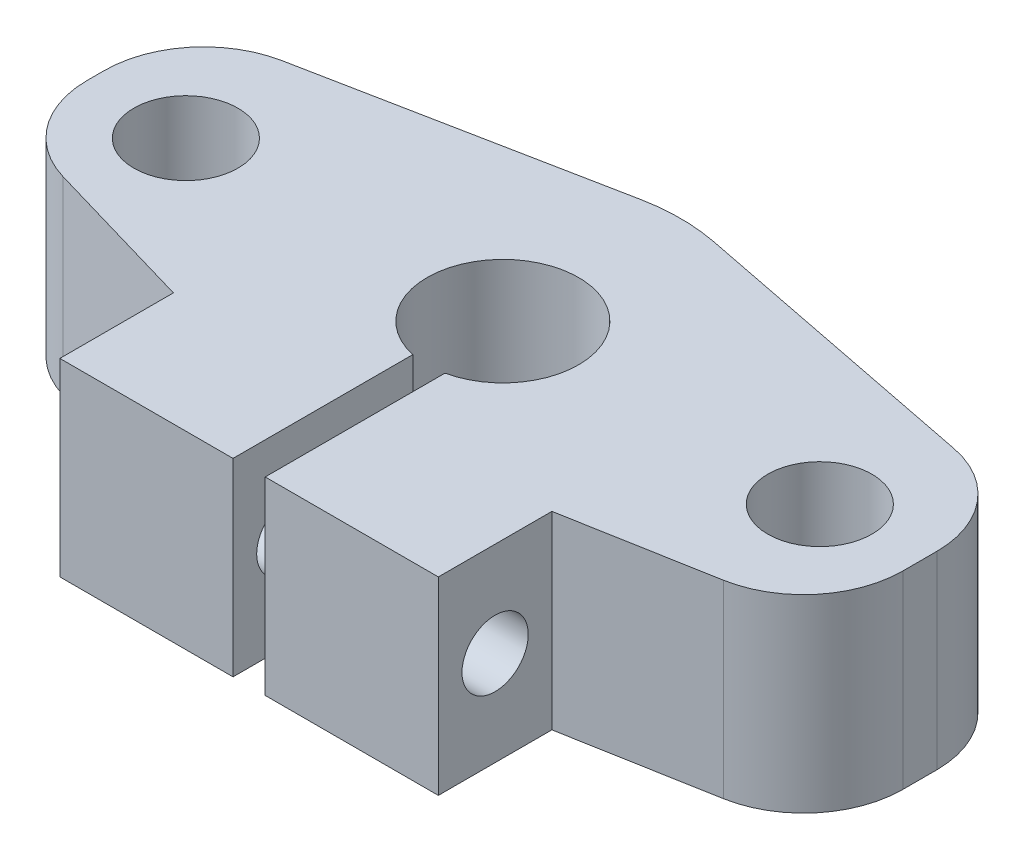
ISO-10303-21;
HEADER;
FILE_DESCRIPTION(('STEP AP214'),'2;1');
FILE_NAME('part.step','',(''),(''),'','','');
FILE_SCHEMA(('AUTOMOTIVE_DESIGN { 1 0 10303 214 1 1 1 1 }'));
ENDSEC;
DATA;
#1=APPLICATION_CONTEXT('core data for automotive mechanical design processes');
#2=APPLICATION_PROTOCOL_DEFINITION('international standard','automotive_design',2000,#1);
#3=PRODUCT_CONTEXT('',#1,'mechanical');
#4=PRODUCT('Part','Part','',(#3));
#5=PRODUCT_RELATED_PRODUCT_CATEGORY('part','',(#4));
#6=PRODUCT_DEFINITION_FORMATION('','',#4);
#7=PRODUCT_DEFINITION_CONTEXT('part definition',#1,'design');
#8=PRODUCT_DEFINITION('design','',#6,#7);
#9=PRODUCT_DEFINITION_SHAPE('','',#8);
#10=(LENGTH_UNIT() NAMED_UNIT(*) SI_UNIT(.MILLI.,.METRE.));
#11=(NAMED_UNIT(*) PLANE_ANGLE_UNIT() SI_UNIT($,.RADIAN.));
#12=(NAMED_UNIT(*) SI_UNIT($,.STERADIAN.) SOLID_ANGLE_UNIT());
#13=UNCERTAINTY_MEASURE_WITH_UNIT(LENGTH_MEASURE(1.E-05),#10,'distance_accuracy_value','');
#14=(GEOMETRIC_REPRESENTATION_CONTEXT(3) GLOBAL_UNCERTAINTY_ASSIGNED_CONTEXT((#13)) GLOBAL_UNIT_ASSIGNED_CONTEXT((#10,
#11,#12)) REPRESENTATION_CONTEXT('',''));
#15=CARTESIAN_POINT('',(0.,0.,0.));
#16=DIRECTION('',(0.,0.,1.));
#17=DIRECTION('',(1.,0.,0.));
#18=AXIS2_PLACEMENT_3D('',#15,#16,#17);
#19=CARTESIAN_POINT('',(0.,10.,-13.409530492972));
#20=DIRECTION('',(0.,1.,0.));
#21=DIRECTION('',(0.,0.,1.));
#22=AXIS2_PLACEMENT_3D('',#19,#20,#21);
#23=PLANE('',#22);
#24=CARTESIAN_POINT('',(16.75,10.,-13.409530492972));
#25=DIRECTION('',(0.,1.,0.));
#26=DIRECTION('',(0.,0.,1.));
#27=AXIS2_PLACEMENT_3D('',#24,#25,#26);
#28=CIRCLE('',#27,2.75);
#29=CARTESIAN_POINT('',(16.75,10.,-10.659530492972));
#30=VERTEX_POINT('',#29);
#31=EDGE_CURVE('E319',#30,#30,#28,.T.);
#32=ORIENTED_EDGE('',*,*,#31,.F.);
#33=EDGE_LOOP('',(#32));
#34=FACE_BOUND('',#33,.T.);
#35=DIRECTION('',(-0.981087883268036,0.,-0.193562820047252));
#36=VECTOR('',#35,1.);
#37=CARTESIAN_POINT('',(22.,10.,-18.659530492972));
#38=LINE('',#37,#36);
#39=CARTESIAN_POINT('',(17.7662048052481,10.,-19.4948331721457));
#40=VERTEX_POINT('',#39);
#41=CARTESIAN_POINT('',(1.93562820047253,10.,-22.618112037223));
#42=VERTEX_POINT('',#41);
#43=EDGE_CURVE('E302',#40,#42,#38,.T.);
#44=ORIENTED_EDGE('',*,*,#43,.T.);
#45=CARTESIAN_POINT('',(0.,10.,-12.8072332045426));
#46=DIRECTION('',(0.,1.,0.));
#47=DIRECTION('',(0.,0.,1.));
#48=AXIS2_PLACEMENT_3D('',#45,#46,#47);
#49=CIRCLE('',#48,10.);
#50=CARTESIAN_POINT('',(-1.93562820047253,10.,-22.618112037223));
#51=VERTEX_POINT('',#50);
#52=EDGE_CURVE('E11',#42,#51,#49,.T.);
#53=ORIENTED_EDGE('',*,*,#52,.T.);
#54=DIRECTION('',(-0.981087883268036,0.,0.193562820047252));
#55=VECTOR('',#54,1.);
#56=CARTESIAN_POINT('',(0.,10.,-23.));
#57=LINE('',#56,#55);
#58=CARTESIAN_POINT('',(-17.7662048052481,10.,-19.4948331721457));
#59=VERTEX_POINT('',#58);
#60=EDGE_CURVE('E233',#51,#59,#57,.T.);
#61=ORIENTED_EDGE('',*,*,#60,.T.);
#62=CARTESIAN_POINT('',(-16.75,10.,-14.3441217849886));
#63=DIRECTION('',(0.,1.,0.));
#64=DIRECTION('',(0.,0.,1.));
#65=AXIS2_PLACEMENT_3D('',#62,#63,#64);
#66=CIRCLE('',#65,5.25);
#67=CARTESIAN_POINT('',(-22.,10.,-14.3441217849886));
#68=VERTEX_POINT('',#67);
#69=EDGE_CURVE('E196',#59,#68,#66,.T.);
#70=ORIENTED_EDGE('',*,*,#69,.T.);
#71=DIRECTION('',(0.,0.,1.));
#72=VECTOR('',#71,1.);
#73=CARTESIAN_POINT('',(-22.,10.,-9.5));
#74=LINE('',#73,#72);
#75=CARTESIAN_POINT('',(-22.,10.,-13.4375));
#76=VERTEX_POINT('',#75);
#77=EDGE_CURVE('E306',#68,#76,#74,.T.);
#78=ORIENTED_EDGE('',*,*,#77,.T.);
#79=CARTESIAN_POINT('',(-16.75,10.,-13.4375));
#80=DIRECTION('',(0.,1.,0.));
#81=DIRECTION('',(0.,0.,1.));
#82=AXIS2_PLACEMENT_3D('',#79,#80,#81);
#83=CIRCLE('',#82,5.25);
#84=CARTESIAN_POINT('',(-18.22,10.,-8.3975));
#85=VERTEX_POINT('',#84);
#86=EDGE_CURVE('E205',#76,#85,#83,.T.);
#87=ORIENTED_EDGE('',*,*,#86,.T.);
#88=DIRECTION('',(0.96,0.,0.28));
#89=VECTOR('',#88,1.);
#90=CARTESIAN_POINT('',(-10.,10.,-6.));
#91=LINE('',#90,#89);
#92=CARTESIAN_POINT('',(-10.,10.,-6.));
#93=VERTEX_POINT('',#92);
#94=EDGE_CURVE('E314',#85,#93,#91,.T.);
#95=ORIENTED_EDGE('',*,*,#94,.T.);
#96=DIRECTION('',(0.,0.,1.));
#97=VECTOR('',#96,1.);
#98=CARTESIAN_POINT('',(-10.,10.,0.));
#99=LINE('',#98,#97);
#100=CARTESIAN_POINT('',(-10.,10.,0.));
#101=VERTEX_POINT('',#100);
#102=EDGE_CURVE('E316',#93,#101,#99,.T.);
#103=ORIENTED_EDGE('',*,*,#102,.T.);
#104=DIRECTION('',(1.,0.,0.));
#105=VECTOR('',#104,1.);
#106=CARTESIAN_POINT('',(-10.,10.,0.));
#107=LINE('',#106,#105);
#108=CARTESIAN_POINT('',(-0.85,10.,0.));
#109=VERTEX_POINT('',#108);
#110=EDGE_CURVE('E173',#101,#109,#107,.T.);
#111=ORIENTED_EDGE('',*,*,#110,.T.);
#112=DIRECTION('',(0.,0.,-1.));
#113=VECTOR('',#112,1.);
#114=CARTESIAN_POINT('',(-0.85,10.,0.));
#115=LINE('',#114,#113);
#116=CARTESIAN_POINT('',(-0.85,10.,-9.5));
#117=VERTEX_POINT('',#116);
#118=EDGE_CURVE('E168',#109,#117,#115,.T.);
#119=ORIENTED_EDGE('',*,*,#118,.T.);
#120=CARTESIAN_POINT('',(0.,10.,-13.409530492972));
#121=DIRECTION('',(0.,-1.,0.));
#122=DIRECTION('',(0.,0.,1.));
#123=AXIS2_PLACEMENT_3D('',#120,#121,#122);
#124=CIRCLE('',#123,4.00086599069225);
#125=CARTESIAN_POINT('',(0.85,10.,-9.5));
#126=VERTEX_POINT('',#125);
#127=EDGE_CURVE('E157',#117,#126,#124,.T.);
#128=ORIENTED_EDGE('',*,*,#127,.T.);
#129=DIRECTION('',(0.,0.,1.));
#130=VECTOR('',#129,1.);
#131=CARTESIAN_POINT('',(0.85,10.,0.));
#132=LINE('',#131,#130);
#133=CARTESIAN_POINT('',(0.85,10.,0.));
#134=VERTEX_POINT('',#133);
#135=EDGE_CURVE('E167',#126,#134,#132,.T.);
#136=ORIENTED_EDGE('',*,*,#135,.T.);
#137=DIRECTION('',(1.,0.,0.));
#138=VECTOR('',#137,1.);
#139=CARTESIAN_POINT('',(10.,10.,0.));
#140=LINE('',#139,#138);
#141=CARTESIAN_POINT('',(10.,10.,0.));
#142=VERTEX_POINT('',#141);
#143=EDGE_CURVE('E275',#134,#142,#140,.T.);
#144=ORIENTED_EDGE('',*,*,#143,.T.);
#145=DIRECTION('',(0.,0.,-1.));
#146=VECTOR('',#145,1.);
#147=CARTESIAN_POINT('',(10.,10.,0.));
#148=LINE('',#147,#146);
#149=CARTESIAN_POINT('',(10.,10.,-6.));
#150=VERTEX_POINT('',#149);
#151=EDGE_CURVE('E322',#142,#150,#148,.T.);
#152=ORIENTED_EDGE('',*,*,#151,.T.);
#153=DIRECTION('',(0.984190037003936,0.,-0.177115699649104));
#154=VECTOR('',#153,1.);
#155=CARTESIAN_POINT('',(10.,10.,-6.));
#156=LINE('',#155,#154);
#157=CARTESIAN_POINT('',(17.6798574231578,10.,-7.38207385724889));
#158=VERTEX_POINT('',#157);
#159=EDGE_CURVE('E308',#150,#158,#156,.T.);
#160=ORIENTED_EDGE('',*,*,#159,.T.);
#161=CARTESIAN_POINT('',(16.75,10.,-12.5490715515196));
#162=DIRECTION('',(0.,1.,0.));
#163=DIRECTION('',(0.,0.,1.));
#164=AXIS2_PLACEMENT_3D('',#161,#162,#163);
#165=CIRCLE('',#164,5.25);
#166=CARTESIAN_POINT('',(22.,10.,-12.5490715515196));
#167=VERTEX_POINT('',#166);
#168=EDGE_CURVE('E214',#158,#167,#165,.T.);
#169=ORIENTED_EDGE('',*,*,#168,.T.);
#170=DIRECTION('',(0.,0.,-1.));
#171=VECTOR('',#170,1.);
#172=CARTESIAN_POINT('',(22.,10.,-10.659530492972));
#173=LINE('',#172,#171);
#174=CARTESIAN_POINT('',(22.,10.,-14.3441217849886));
#175=VERTEX_POINT('',#174);
#176=EDGE_CURVE('E303',#167,#175,#173,.T.);
#177=ORIENTED_EDGE('',*,*,#176,.T.);
#178=CARTESIAN_POINT('',(16.75,10.,-14.3441217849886));
#179=DIRECTION('',(0.,1.,0.));
#180=DIRECTION('',(0.,0.,1.));
#181=AXIS2_PLACEMENT_3D('',#178,#179,#180);
#182=CIRCLE('',#181,5.25);
#183=EDGE_CURVE('E223',#175,#40,#182,.T.);
#184=ORIENTED_EDGE('',*,*,#183,.T.);
#185=EDGE_LOOP('',(#44,#53,#61,#70,#78,#87,#95,#103,#111,#119,#128,#136,#144,#152,#160,#169,
#177,#184));
#186=FACE_BOUND('',#185,.T.);
#187=CARTESIAN_POINT('',(-16.75,10.,-13.409530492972));
#188=DIRECTION('',(0.,1.,0.));
#189=DIRECTION('',(0.,0.,1.));
#190=AXIS2_PLACEMENT_3D('',#187,#188,#189);
#191=CIRCLE('',#190,2.75);
#192=CARTESIAN_POINT('',(-16.75,10.,-10.659530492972));
#193=VERTEX_POINT('',#192);
#194=EDGE_CURVE('E567',#193,#193,#191,.T.);
#195=ORIENTED_EDGE('',*,*,#194,.F.);
#196=EDGE_LOOP('',(#195));
#197=FACE_BOUND('',#196,.T.);
#198=ADVANCED_FACE('F32',(#34,#186,#197),#23,.T.);
#199=CARTESIAN_POINT('',(0.,0.,-13.409530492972));
#200=DIRECTION('',(0.,1.,0.));
#201=DIRECTION('',(0.,0.,1.));
#202=AXIS2_PLACEMENT_3D('',#199,#200,#201);
#203=PLANE('',#202);
#204=CARTESIAN_POINT('',(16.75,0.,-13.409530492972));
#205=DIRECTION('',(0.,1.,0.));
#206=DIRECTION('',(0.,0.,1.));
#207=AXIS2_PLACEMENT_3D('',#204,#205,#206);
#208=CIRCLE('',#207,2.75);
#209=CARTESIAN_POINT('',(16.75,0.,-10.659530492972));
#210=VERTEX_POINT('',#209);
#211=EDGE_CURVE('E575',#210,#210,#208,.T.);
#212=ORIENTED_EDGE('',*,*,#211,.T.);
#213=EDGE_LOOP('',(#212));
#214=FACE_BOUND('',#213,.T.);
#215=DIRECTION('',(-0.981087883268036,0.,0.193562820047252));
#216=VECTOR('',#215,1.);
#217=CARTESIAN_POINT('',(0.,0.,-23.));
#218=LINE('',#217,#216);
#219=CARTESIAN_POINT('',(-1.93562820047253,0.,-22.618112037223));
#220=VERTEX_POINT('',#219);
#221=CARTESIAN_POINT('',(-17.7662048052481,0.,-19.4948331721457));
#222=VERTEX_POINT('',#221);
#223=EDGE_CURVE('E232',#220,#222,#218,.T.);
#224=ORIENTED_EDGE('',*,*,#223,.F.);
#225=CARTESIAN_POINT('',(0.,0.,-12.8072332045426));
#226=DIRECTION('',(0.,1.,0.));
#227=DIRECTION('',(0.,0.,1.));
#228=AXIS2_PLACEMENT_3D('',#225,#226,#227);
#229=CIRCLE('',#228,10.);
#230=CARTESIAN_POINT('',(1.93562820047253,0.,-22.618112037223));
#231=VERTEX_POINT('',#230);
#232=EDGE_CURVE('E54',#220,#231,#229,.F.);
#233=ORIENTED_EDGE('',*,*,#232,.T.);
#234=DIRECTION('',(-0.981087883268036,0.,-0.193562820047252));
#235=VECTOR('',#234,1.);
#236=CARTESIAN_POINT('',(22.,0.,-18.659530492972));
#237=LINE('',#236,#235);
#238=CARTESIAN_POINT('',(17.7662048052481,0.,-19.4948331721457));
#239=VERTEX_POINT('',#238);
#240=EDGE_CURVE('E241',#239,#231,#237,.T.);
#241=ORIENTED_EDGE('',*,*,#240,.F.);
#242=CARTESIAN_POINT('',(16.75,0.,-14.3441217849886));
#243=DIRECTION('',(0.,1.,0.));
#244=DIRECTION('',(0.,0.,1.));
#245=AXIS2_PLACEMENT_3D('',#242,#243,#244);
#246=CIRCLE('',#245,5.25);
#247=CARTESIAN_POINT('',(22.,0.,-14.3441217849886));
#248=VERTEX_POINT('',#247);
#249=EDGE_CURVE('E219',#239,#248,#246,.F.);
#250=ORIENTED_EDGE('',*,*,#249,.T.);
#251=DIRECTION('',(0.,0.,-1.));
#252=VECTOR('',#251,1.);
#253=CARTESIAN_POINT('',(22.,0.,-16.159530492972));
#254=LINE('',#253,#252);
#255=CARTESIAN_POINT('',(22.,0.,-12.5490715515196));
#256=VERTEX_POINT('',#255);
#257=EDGE_CURVE('E246',#256,#248,#254,.T.);
#258=ORIENTED_EDGE('',*,*,#257,.F.);
#259=CARTESIAN_POINT('',(16.75,0.,-12.5490715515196));
#260=DIRECTION('',(0.,1.,0.));
#261=DIRECTION('',(0.,0.,1.));
#262=AXIS2_PLACEMENT_3D('',#259,#260,#261);
#263=CIRCLE('',#262,5.25);
#264=CARTESIAN_POINT('',(17.6798574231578,0.,-7.38207385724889));
#265=VERTEX_POINT('',#264);
#266=EDGE_CURVE('E210',#256,#265,#263,.F.);
#267=ORIENTED_EDGE('',*,*,#266,.T.);
#268=DIRECTION('',(0.984190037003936,0.,-0.177115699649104));
#269=VECTOR('',#268,1.);
#270=CARTESIAN_POINT('',(10.,0.,-6.));
#271=LINE('',#270,#269);
#272=CARTESIAN_POINT('',(10.,0.,-6.));
#273=VERTEX_POINT('',#272);
#274=EDGE_CURVE('E283',#273,#265,#271,.T.);
#275=ORIENTED_EDGE('',*,*,#274,.F.);
#276=DIRECTION('',(0.,0.,-1.));
#277=VECTOR('',#276,1.);
#278=CARTESIAN_POINT('',(10.,0.,0.));
#279=LINE('',#278,#277);
#280=CARTESIAN_POINT('',(10.,0.,0.));
#281=VERTEX_POINT('',#280);
#282=EDGE_CURVE('E281',#281,#273,#279,.T.);
#283=ORIENTED_EDGE('',*,*,#282,.F.);
#284=DIRECTION('',(1.,0.,0.));
#285=VECTOR('',#284,1.);
#286=CARTESIAN_POINT('',(10.,0.,0.));
#287=LINE('',#286,#285);
#288=CARTESIAN_POINT('',(0.85,0.,0.));
#289=VERTEX_POINT('',#288);
#290=EDGE_CURVE('E274',#289,#281,#287,.T.);
#291=ORIENTED_EDGE('',*,*,#290,.F.);
#292=DIRECTION('',(0.,0.,1.));
#293=VECTOR('',#292,1.);
#294=CARTESIAN_POINT('',(0.85,0.,0.));
#295=LINE('',#294,#293);
#296=CARTESIAN_POINT('',(0.85,0.,-9.5));
#297=VERTEX_POINT('',#296);
#298=EDGE_CURVE('E279',#297,#289,#295,.T.);
#299=ORIENTED_EDGE('',*,*,#298,.F.);
#300=CARTESIAN_POINT('',(0.,0.,-13.409530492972));
#301=DIRECTION('',(0.,-1.,0.));
#302=DIRECTION('',(0.,0.,1.));
#303=AXIS2_PLACEMENT_3D('',#300,#301,#302);
#304=CIRCLE('',#303,4.00086599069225);
#305=CARTESIAN_POINT('',(-0.85,0.,-9.5));
#306=VERTEX_POINT('',#305);
#307=EDGE_CURVE('E285',#306,#297,#304,.T.);
#308=ORIENTED_EDGE('',*,*,#307,.F.);
#309=DIRECTION('',(0.,0.,-1.));
#310=VECTOR('',#309,1.);
#311=CARTESIAN_POINT('',(-0.85,0.,0.));
#312=LINE('',#311,#310);
#313=CARTESIAN_POINT('',(-0.85,0.,0.));
#314=VERTEX_POINT('',#313);
#315=EDGE_CURVE('E181',#314,#306,#312,.T.);
#316=ORIENTED_EDGE('',*,*,#315,.F.);
#317=DIRECTION('',(1.,0.,0.));
#318=VECTOR('',#317,1.);
#319=CARTESIAN_POINT('',(-10.,0.,0.));
#320=LINE('',#319,#318);
#321=CARTESIAN_POINT('',(-10.,0.,0.));
#322=VERTEX_POINT('',#321);
#323=EDGE_CURVE('E177',#322,#314,#320,.T.);
#324=ORIENTED_EDGE('',*,*,#323,.F.);
#325=DIRECTION('',(0.,0.,1.));
#326=VECTOR('',#325,1.);
#327=CARTESIAN_POINT('',(-10.,0.,0.));
#328=LINE('',#327,#326);
#329=CARTESIAN_POINT('',(-10.,0.,-6.));
#330=VERTEX_POINT('',#329);
#331=EDGE_CURVE('E251',#330,#322,#328,.T.);
#332=ORIENTED_EDGE('',*,*,#331,.F.);
#333=DIRECTION('',(0.96,0.,0.28));
#334=VECTOR('',#333,1.);
#335=CARTESIAN_POINT('',(-10.,0.,-6.));
#336=LINE('',#335,#334);
#337=CARTESIAN_POINT('',(-18.22,0.,-8.3975));
#338=VERTEX_POINT('',#337);
#339=EDGE_CURVE('E244',#338,#330,#336,.T.);
#340=ORIENTED_EDGE('',*,*,#339,.F.);
#341=CARTESIAN_POINT('',(-16.75,0.,-13.4375));
#342=DIRECTION('',(0.,1.,0.));
#343=DIRECTION('',(0.,0.,1.));
#344=AXIS2_PLACEMENT_3D('',#341,#342,#343);
#345=CIRCLE('',#344,5.25);
#346=CARTESIAN_POINT('',(-22.,0.,-13.4375));
#347=VERTEX_POINT('',#346);
#348=EDGE_CURVE('E201',#338,#347,#345,.F.);
#349=ORIENTED_EDGE('',*,*,#348,.T.);
#350=DIRECTION('',(0.,0.,1.));
#351=VECTOR('',#350,1.);
#352=CARTESIAN_POINT('',(-22.,0.,-9.5));
#353=LINE('',#352,#351);
#354=CARTESIAN_POINT('',(-22.,0.,-14.3441217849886));
#355=VERTEX_POINT('',#354);
#356=EDGE_CURVE('E240',#355,#347,#353,.T.);
#357=ORIENTED_EDGE('',*,*,#356,.F.);
#358=CARTESIAN_POINT('',(-16.75,0.,-14.3441217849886));
#359=DIRECTION('',(0.,1.,0.));
#360=DIRECTION('',(0.,0.,1.));
#361=AXIS2_PLACEMENT_3D('',#358,#359,#360);
#362=CIRCLE('',#361,5.25);
#363=EDGE_CURVE('E185',#355,#222,#362,.F.);
#364=ORIENTED_EDGE('',*,*,#363,.T.);
#365=EDGE_LOOP('',(#224,#233,#241,#250,#258,#267,#275,#283,#291,#299,#308,#316,#324,#332,#340,
#349,#357,#364));
#366=FACE_BOUND('',#365,.T.);
#367=CARTESIAN_POINT('',(-16.75,0.,-13.409530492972));
#368=DIRECTION('',(0.,1.,0.));
#369=DIRECTION('',(0.,0.,1.));
#370=AXIS2_PLACEMENT_3D('',#367,#368,#369);
#371=CIRCLE('',#370,2.75);
#372=CARTESIAN_POINT('',(-16.75,0.,-10.659530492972));
#373=VERTEX_POINT('',#372);
#374=EDGE_CURVE('E563',#373,#373,#371,.T.);
#375=ORIENTED_EDGE('',*,*,#374,.T.);
#376=EDGE_LOOP('',(#375));
#377=FACE_BOUND('',#376,.T.);
#378=ADVANCED_FACE('F236',(#214,#366,#377),#203,.F.);
#379=CARTESIAN_POINT('',(-0.85,10.,0.));
#380=DIRECTION('',(-1.,0.,0.));
#381=DIRECTION('',(0.,0.,1.));
#382=AXIS2_PLACEMENT_3D('',#379,#380,#381);
#383=PLANE('',#382);
#384=CARTESIAN_POINT('',(-0.85,5.,-3.));
#385=DIRECTION('',(-1.,0.,0.));
#386=DIRECTION('',(0.,0.,1.));
#387=AXIS2_PLACEMENT_3D('',#384,#385,#386);
#388=CIRCLE('',#387,1.75);
#389=CARTESIAN_POINT('',(-0.85,5.,-1.25));
#390=VERTEX_POINT('',#389);
#391=EDGE_CURVE('E561',#390,#390,#388,.T.);
#392=ORIENTED_EDGE('',*,*,#391,.T.);
#393=EDGE_LOOP('',(#392));
#394=FACE_BOUND('',#393,.T.);
#395=ORIENTED_EDGE('',*,*,#315,.T.);
#396=DIRECTION('',(0.,-1.,0.));
#397=VECTOR('',#396,1.);
#398=CARTESIAN_POINT('',(-0.85,10.,-9.5));
#399=LINE('',#398,#397);
#400=EDGE_CURVE('E161',#117,#306,#399,.T.);
#401=ORIENTED_EDGE('',*,*,#400,.F.);
#402=ORIENTED_EDGE('',*,*,#118,.F.);
#403=DIRECTION('',(0.,-1.,0.));
#404=VECTOR('',#403,1.);
#405=CARTESIAN_POINT('',(-0.85,10.,0.));
#406=LINE('',#405,#404);
#407=EDGE_CURVE('E254',#109,#314,#406,.T.);
#408=ORIENTED_EDGE('',*,*,#407,.T.);
#409=EDGE_LOOP('',(#395,#401,#402,#408));
#410=FACE_BOUND('',#409,.T.);
#411=ADVANCED_FACE('F179',(#394,#410),#383,.F.);
#412=CARTESIAN_POINT('',(0.,10.,-13.409530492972));
#413=DIRECTION('',(0.,-1.,0.));
#414=DIRECTION('',(0.,0.,-1.));
#415=AXIS2_PLACEMENT_3D('',#412,#413,#414);
#416=CYLINDRICAL_SURFACE('',#415,4.00086599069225);
#417=ORIENTED_EDGE('',*,*,#307,.T.);
#418=DIRECTION('',(0.,-1.,0.));
#419=VECTOR('',#418,1.);
#420=CARTESIAN_POINT('',(0.85,10.,-9.5));
#421=LINE('',#420,#419);
#422=EDGE_CURVE('E164',#126,#297,#421,.T.);
#423=ORIENTED_EDGE('',*,*,#422,.F.);
#424=ORIENTED_EDGE('',*,*,#127,.F.);
#425=ORIENTED_EDGE('',*,*,#400,.T.);
#426=EDGE_LOOP('',(#417,#423,#424,#425));
#427=FACE_BOUND('',#426,.T.);
#428=ADVANCED_FACE('F159',(#427),#416,.F.);
#429=CARTESIAN_POINT('',(0.85,10.,0.));
#430=DIRECTION('',(1.,0.,0.));
#431=DIRECTION('',(0.,0.,-1.));
#432=AXIS2_PLACEMENT_3D('',#429,#430,#431);
#433=PLANE('',#432);
#434=CARTESIAN_POINT('',(0.85,5.,-3.));
#435=DIRECTION('',(1.,0.,0.));
#436=DIRECTION('',(0.,0.,-1.));
#437=AXIS2_PLACEMENT_3D('',#434,#435,#436);
#438=CIRCLE('',#437,1.75);
#439=CARTESIAN_POINT('',(0.85,5.,-4.75));
#440=VERTEX_POINT('',#439);
#441=EDGE_CURVE('E564',#440,#440,#438,.T.);
#442=ORIENTED_EDGE('',*,*,#441,.T.);
#443=EDGE_LOOP('',(#442));
#444=FACE_BOUND('',#443,.T.);
#445=ORIENTED_EDGE('',*,*,#298,.T.);
#446=DIRECTION('',(0.,-1.,0.));
#447=VECTOR('',#446,1.);
#448=CARTESIAN_POINT('',(0.85,10.,0.));
#449=LINE('',#448,#447);
#450=EDGE_CURVE('E187',#134,#289,#449,.T.);
#451=ORIENTED_EDGE('',*,*,#450,.F.);
#452=ORIENTED_EDGE('',*,*,#135,.F.);
#453=ORIENTED_EDGE('',*,*,#422,.T.);
#454=EDGE_LOOP('',(#445,#451,#452,#453));
#455=FACE_BOUND('',#454,.T.);
#456=ADVANCED_FACE('F320',(#444,#455),#433,.F.);
#457=CARTESIAN_POINT('',(10.,10.,0.));
#458=DIRECTION('',(0.,0.,-1.));
#459=DIRECTION('',(-1.,0.,0.));
#460=AXIS2_PLACEMENT_3D('',#457,#458,#459);
#461=PLANE('',#460);
#462=ORIENTED_EDGE('',*,*,#290,.T.);
#463=DIRECTION('',(0.,-1.,0.));
#464=VECTOR('',#463,1.);
#465=CARTESIAN_POINT('',(10.,10.,0.));
#466=LINE('',#465,#464);
#467=EDGE_CURVE('E265',#142,#281,#466,.T.);
#468=ORIENTED_EDGE('',*,*,#467,.F.);
#469=ORIENTED_EDGE('',*,*,#143,.F.);
#470=ORIENTED_EDGE('',*,*,#450,.T.);
#471=EDGE_LOOP('',(#462,#468,#469,#470));
#472=FACE_BOUND('',#471,.T.);
#473=ADVANCED_FACE('F272',(#472),#461,.F.);
#474=CARTESIAN_POINT('',(10.,10.,0.));
#475=DIRECTION('',(-1.,0.,0.));
#476=DIRECTION('',(0.,0.,1.));
#477=AXIS2_PLACEMENT_3D('',#474,#475,#476);
#478=PLANE('',#477);
#479=CARTESIAN_POINT('',(10.,5.,-3.));
#480=DIRECTION('',(-1.,0.,0.));
#481=DIRECTION('',(0.,0.,1.));
#482=AXIS2_PLACEMENT_3D('',#479,#480,#481);
#483=CIRCLE('',#482,1.75);
#484=CARTESIAN_POINT('',(10.,5.,-1.25));
#485=VERTEX_POINT('',#484);
#486=EDGE_CURVE('E570',#485,#485,#483,.T.);
#487=ORIENTED_EDGE('',*,*,#486,.T.);
#488=EDGE_LOOP('',(#487));
#489=FACE_BOUND('',#488,.T.);
#490=ORIENTED_EDGE('',*,*,#282,.T.);
#491=DIRECTION('',(0.,-1.,0.));
#492=VECTOR('',#491,1.);
#493=CARTESIAN_POINT('',(10.,10.,-6.));
#494=LINE('',#493,#492);
#495=EDGE_CURVE('E262',#150,#273,#494,.T.);
#496=ORIENTED_EDGE('',*,*,#495,.F.);
#497=ORIENTED_EDGE('',*,*,#151,.F.);
#498=ORIENTED_EDGE('',*,*,#467,.T.);
#499=EDGE_LOOP('',(#490,#496,#497,#498));
#500=FACE_BOUND('',#499,.T.);
#501=ADVANCED_FACE('F336',(#489,#500),#478,.F.);
#502=CARTESIAN_POINT('',(10.,10.,-6.));
#503=DIRECTION('',(-0.177115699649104,0.,-0.984190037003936));
#504=DIRECTION('',(-0.984190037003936,0.,0.177115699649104));
#505=AXIS2_PLACEMENT_3D('',#502,#503,#504);
#506=PLANE('',#505);
#507=ORIENTED_EDGE('',*,*,#274,.T.);
#508=DIRECTION('',(0.,-1.,0.));
#509=VECTOR('',#508,1.);
#510=CARTESIAN_POINT('',(17.6798574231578,10.,-7.38207385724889));
#511=LINE('',#510,#509);
#512=EDGE_CURVE('E212',#265,#158,#511,.F.);
#513=ORIENTED_EDGE('',*,*,#512,.T.);
#514=ORIENTED_EDGE('',*,*,#159,.F.);
#515=ORIENTED_EDGE('',*,*,#495,.T.);
#516=EDGE_LOOP('',(#507,#513,#514,#515));
#517=FACE_BOUND('',#516,.T.);
#518=ADVANCED_FACE('F334',(#517),#506,.F.);
#519=CARTESIAN_POINT('',(22.,10.,-16.159530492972));
#520=DIRECTION('',(-1.,0.,0.));
#521=DIRECTION('',(0.,0.,1.));
#522=AXIS2_PLACEMENT_3D('',#519,#520,#521);
#523=PLANE('',#522);
#524=ORIENTED_EDGE('',*,*,#257,.T.);
#525=DIRECTION('',(0.,-1.,0.));
#526=VECTOR('',#525,1.);
#527=CARTESIAN_POINT('',(22.,10.,-14.3441217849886));
#528=LINE('',#527,#526);
#529=EDGE_CURVE('E221',#248,#175,#528,.F.);
#530=ORIENTED_EDGE('',*,*,#529,.T.);
#531=ORIENTED_EDGE('',*,*,#176,.F.);
#532=DIRECTION('',(0.,-1.,0.));
#533=VECTOR('',#532,1.);
#534=CARTESIAN_POINT('',(22.,10.,-12.5490715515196));
#535=LINE('',#534,#533);
#536=EDGE_CURVE('E207',#167,#256,#535,.T.);
#537=ORIENTED_EDGE('',*,*,#536,.T.);
#538=EDGE_LOOP('',(#524,#530,#531,#537));
#539=FACE_BOUND('',#538,.T.);
#540=ADVANCED_FACE('F294',(#539),#523,.F.);
#541=CARTESIAN_POINT('',(22.,10.,-18.659530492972));
#542=DIRECTION('',(-0.193562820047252,0.,0.981087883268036));
#543=DIRECTION('',(0.981087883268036,0.,0.193562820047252));
#544=AXIS2_PLACEMENT_3D('',#541,#542,#543);
#545=PLANE('',#544);
#546=ORIENTED_EDGE('',*,*,#240,.T.);
#547=DIRECTION('',(0.,-1.,0.));
#548=VECTOR('',#547,1.);
#549=CARTESIAN_POINT('',(1.93562820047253,10.,-22.618112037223));
#550=LINE('',#549,#548);
#551=EDGE_CURVE('E40',#231,#42,#550,.F.);
#552=ORIENTED_EDGE('',*,*,#551,.T.);
#553=ORIENTED_EDGE('',*,*,#43,.F.);
#554=DIRECTION('',(0.,-1.,0.));
#555=VECTOR('',#554,1.);
#556=CARTESIAN_POINT('',(17.7662048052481,10.,-19.4948331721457));
#557=LINE('',#556,#555);
#558=EDGE_CURVE('E216',#40,#239,#557,.T.);
#559=ORIENTED_EDGE('',*,*,#558,.T.);
#560=EDGE_LOOP('',(#546,#552,#553,#559));
#561=FACE_BOUND('',#560,.T.);
#562=ADVANCED_FACE('F304',(#561),#545,.F.);
#563=CARTESIAN_POINT('',(0.,10.,-23.));
#564=DIRECTION('',(0.193562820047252,0.,0.981087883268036));
#565=DIRECTION('',(0.981087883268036,0.,-0.193562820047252));
#566=AXIS2_PLACEMENT_3D('',#563,#564,#565);
#567=PLANE('',#566);
#568=ORIENTED_EDGE('',*,*,#60,.F.);
#569=DIRECTION('',(0.,-1.,0.));
#570=VECTOR('',#569,1.);
#571=CARTESIAN_POINT('',(-1.93562820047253,10.,-22.618112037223));
#572=LINE('',#571,#570);
#573=EDGE_CURVE('E225',#51,#220,#572,.T.);
#574=ORIENTED_EDGE('',*,*,#573,.T.);
#575=ORIENTED_EDGE('',*,*,#223,.T.);
#576=DIRECTION('',(0.,-1.,0.));
#577=VECTOR('',#576,1.);
#578=CARTESIAN_POINT('',(-17.7662048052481,10.,-19.4948331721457));
#579=LINE('',#578,#577);
#580=EDGE_CURVE('E193',#222,#59,#579,.F.);
#581=ORIENTED_EDGE('',*,*,#580,.T.);
#582=EDGE_LOOP('',(#568,#574,#575,#581));
#583=FACE_BOUND('',#582,.T.);
#584=ADVANCED_FACE('F231',(#583),#567,.F.);
#585=CARTESIAN_POINT('',(-22.,10.,-9.5));
#586=DIRECTION('',(1.,0.,0.));
#587=DIRECTION('',(0.,0.,-1.));
#588=AXIS2_PLACEMENT_3D('',#585,#586,#587);
#589=PLANE('',#588);
#590=ORIENTED_EDGE('',*,*,#356,.T.);
#591=DIRECTION('',(0.,-1.,0.));
#592=VECTOR('',#591,1.);
#593=CARTESIAN_POINT('',(-22.,10.,-13.4375));
#594=LINE('',#593,#592);
#595=EDGE_CURVE('E203',#347,#76,#594,.F.);
#596=ORIENTED_EDGE('',*,*,#595,.T.);
#597=ORIENTED_EDGE('',*,*,#77,.F.);
#598=DIRECTION('',(0.,-1.,0.));
#599=VECTOR('',#598,1.);
#600=CARTESIAN_POINT('',(-22.,10.,-14.3441217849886));
#601=LINE('',#600,#599);
#602=EDGE_CURVE('E182',#68,#355,#601,.T.);
#603=ORIENTED_EDGE('',*,*,#602,.T.);
#604=EDGE_LOOP('',(#590,#596,#597,#603));
#605=FACE_BOUND('',#604,.T.);
#606=ADVANCED_FACE('F371',(#605),#589,.F.);
#607=CARTESIAN_POINT('',(-10.,10.,-6.));
#608=DIRECTION('',(0.28,0.,-0.96));
#609=DIRECTION('',(-0.96,0.,-0.28));
#610=AXIS2_PLACEMENT_3D('',#607,#608,#609);
#611=PLANE('',#610);
#612=ORIENTED_EDGE('',*,*,#94,.F.);
#613=DIRECTION('',(0.,-1.,0.));
#614=VECTOR('',#613,1.);
#615=CARTESIAN_POINT('',(-18.22,10.,-8.3975));
#616=LINE('',#615,#614);
#617=EDGE_CURVE('E198',#85,#338,#616,.T.);
#618=ORIENTED_EDGE('',*,*,#617,.T.);
#619=ORIENTED_EDGE('',*,*,#339,.T.);
#620=DIRECTION('',(0.,-1.,0.));
#621=VECTOR('',#620,1.);
#622=CARTESIAN_POINT('',(-10.,10.,-6.));
#623=LINE('',#622,#621);
#624=EDGE_CURVE('E259',#93,#330,#623,.T.);
#625=ORIENTED_EDGE('',*,*,#624,.F.);
#626=EDGE_LOOP('',(#612,#618,#619,#625));
#627=FACE_BOUND('',#626,.T.);
#628=ADVANCED_FACE('F367',(#627),#611,.F.);
#629=CARTESIAN_POINT('',(-10.,10.,0.));
#630=DIRECTION('',(1.,0.,0.));
#631=DIRECTION('',(0.,0.,-1.));
#632=AXIS2_PLACEMENT_3D('',#629,#630,#631);
#633=PLANE('',#632);
#634=CARTESIAN_POINT('',(-10.,5.,-3.));
#635=DIRECTION('',(-1.,0.,0.));
#636=DIRECTION('',(0.,0.,1.));
#637=AXIS2_PLACEMENT_3D('',#634,#635,#636);
#638=CIRCLE('',#637,1.75);
#639=CARTESIAN_POINT('',(-10.,5.,-1.25));
#640=VERTEX_POINT('',#639);
#641=EDGE_CURVE('E585',#640,#640,#638,.T.);
#642=ORIENTED_EDGE('',*,*,#641,.F.);
#643=EDGE_LOOP('',(#642));
#644=FACE_BOUND('',#643,.T.);
#645=ORIENTED_EDGE('',*,*,#331,.T.);
#646=DIRECTION('',(0.,-1.,0.));
#647=VECTOR('',#646,1.);
#648=CARTESIAN_POINT('',(-10.,10.,0.));
#649=LINE('',#648,#647);
#650=EDGE_CURVE('E256',#101,#322,#649,.T.);
#651=ORIENTED_EDGE('',*,*,#650,.F.);
#652=ORIENTED_EDGE('',*,*,#102,.F.);
#653=ORIENTED_EDGE('',*,*,#624,.T.);
#654=EDGE_LOOP('',(#645,#651,#652,#653));
#655=FACE_BOUND('',#654,.T.);
#656=ADVANCED_FACE('F363',(#644,#655),#633,.F.);
#657=CARTESIAN_POINT('',(-10.,10.,0.));
#658=DIRECTION('',(0.,0.,-1.));
#659=DIRECTION('',(-1.,0.,0.));
#660=AXIS2_PLACEMENT_3D('',#657,#658,#659);
#661=PLANE('',#660);
#662=ORIENTED_EDGE('',*,*,#323,.T.);
#663=ORIENTED_EDGE('',*,*,#407,.F.);
#664=ORIENTED_EDGE('',*,*,#110,.F.);
#665=ORIENTED_EDGE('',*,*,#650,.T.);
#666=EDGE_LOOP('',(#662,#663,#664,#665));
#667=FACE_BOUND('',#666,.T.);
#668=ADVANCED_FACE('F360',(#667),#661,.F.);
#669=CARTESIAN_POINT('',(16.75,10.,-13.409530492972));
#670=DIRECTION('',(0.,-1.,0.));
#671=DIRECTION('',(0.,0.,-1.));
#672=AXIS2_PLACEMENT_3D('',#669,#670,#671);
#673=CYLINDRICAL_SURFACE('',#672,2.75);
#674=ORIENTED_EDGE('',*,*,#31,.T.);
#675=EDGE_LOOP('',(#674));
#676=FACE_BOUND('',#675,.T.);
#677=ORIENTED_EDGE('',*,*,#211,.F.);
#678=EDGE_LOOP('',(#677));
#679=FACE_BOUND('',#678,.T.);
#680=ADVANCED_FACE('F357',(#676,#679),#673,.F.);
#681=CARTESIAN_POINT('',(-16.75,10.,-13.409530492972));
#682=DIRECTION('',(0.,-1.,0.));
#683=DIRECTION('',(0.,0.,-1.));
#684=AXIS2_PLACEMENT_3D('',#681,#682,#683);
#685=CYLINDRICAL_SURFACE('',#684,2.75);
#686=ORIENTED_EDGE('',*,*,#194,.T.);
#687=EDGE_LOOP('',(#686));
#688=FACE_BOUND('',#687,.T.);
#689=ORIENTED_EDGE('',*,*,#374,.F.);
#690=EDGE_LOOP('',(#689));
#691=FACE_BOUND('',#690,.T.);
#692=ADVANCED_FACE('F423',(#688,#691),#685,.F.);
#693=CARTESIAN_POINT('',(-16.75,10.,-14.3441217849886));
#694=DIRECTION('',(0.,-1.,0.));
#695=DIRECTION('',(0.,0.,-1.));
#696=AXIS2_PLACEMENT_3D('',#693,#694,#695);
#697=CYLINDRICAL_SURFACE('',#696,5.25);
#698=ORIENTED_EDGE('',*,*,#69,.F.);
#699=ORIENTED_EDGE('',*,*,#580,.F.);
#700=ORIENTED_EDGE('',*,*,#363,.F.);
#701=ORIENTED_EDGE('',*,*,#602,.F.);
#702=EDGE_LOOP('',(#698,#699,#700,#701));
#703=FACE_BOUND('',#702,.T.);
#704=ADVANCED_FACE('F430',(#703),#697,.T.);
#705=CARTESIAN_POINT('',(-16.75,10.,-13.4375));
#706=DIRECTION('',(0.,-1.,0.));
#707=DIRECTION('',(0.,0.,-1.));
#708=AXIS2_PLACEMENT_3D('',#705,#706,#707);
#709=CYLINDRICAL_SURFACE('',#708,5.25);
#710=ORIENTED_EDGE('',*,*,#86,.F.);
#711=ORIENTED_EDGE('',*,*,#595,.F.);
#712=ORIENTED_EDGE('',*,*,#348,.F.);
#713=ORIENTED_EDGE('',*,*,#617,.F.);
#714=EDGE_LOOP('',(#710,#711,#712,#713));
#715=FACE_BOUND('',#714,.T.);
#716=ADVANCED_FACE('F436',(#715),#709,.T.);
#717=CARTESIAN_POINT('',(16.75,10.,-12.5490715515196));
#718=DIRECTION('',(0.,-1.,0.));
#719=DIRECTION('',(0.,0.,-1.));
#720=AXIS2_PLACEMENT_3D('',#717,#718,#719);
#721=CYLINDRICAL_SURFACE('',#720,5.25);
#722=ORIENTED_EDGE('',*,*,#168,.F.);
#723=ORIENTED_EDGE('',*,*,#512,.F.);
#724=ORIENTED_EDGE('',*,*,#266,.F.);
#725=ORIENTED_EDGE('',*,*,#536,.F.);
#726=EDGE_LOOP('',(#722,#723,#724,#725));
#727=FACE_BOUND('',#726,.T.);
#728=ADVANCED_FACE('F333',(#727),#721,.T.);
#729=CARTESIAN_POINT('',(16.75,10.,-14.3441217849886));
#730=DIRECTION('',(0.,-1.,0.));
#731=DIRECTION('',(0.,0.,-1.));
#732=AXIS2_PLACEMENT_3D('',#729,#730,#731);
#733=CYLINDRICAL_SURFACE('',#732,5.25);
#734=ORIENTED_EDGE('',*,*,#183,.F.);
#735=ORIENTED_EDGE('',*,*,#529,.F.);
#736=ORIENTED_EDGE('',*,*,#249,.F.);
#737=ORIENTED_EDGE('',*,*,#558,.F.);
#738=EDGE_LOOP('',(#734,#735,#736,#737));
#739=FACE_BOUND('',#738,.T.);
#740=ADVANCED_FACE('F300',(#739),#733,.T.);
#741=CARTESIAN_POINT('',(0.,10.,-12.8072332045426));
#742=DIRECTION('',(0.,-1.,0.));
#743=DIRECTION('',(0.,0.,-1.));
#744=AXIS2_PLACEMENT_3D('',#741,#742,#743);
#745=CYLINDRICAL_SURFACE('',#744,10.);
#746=ORIENTED_EDGE('',*,*,#52,.F.);
#747=ORIENTED_EDGE('',*,*,#551,.F.);
#748=ORIENTED_EDGE('',*,*,#232,.F.);
#749=ORIENTED_EDGE('',*,*,#573,.F.);
#750=EDGE_LOOP('',(#746,#747,#748,#749));
#751=FACE_BOUND('',#750,.T.);
#752=ADVANCED_FACE('F34',(#751),#745,.T.);
#753=CARTESIAN_POINT('',(10.,5.,-3.));
#754=DIRECTION('',(-1.,0.,0.));
#755=DIRECTION('',(0.,0.,1.));
#756=AXIS2_PLACEMENT_3D('',#753,#754,#755);
#757=CYLINDRICAL_SURFACE('',#756,1.75);
#758=ORIENTED_EDGE('',*,*,#641,.T.);
#759=EDGE_LOOP('',(#758));
#760=FACE_BOUND('',#759,.T.);
#761=ORIENTED_EDGE('',*,*,#391,.F.);
#762=EDGE_LOOP('',(#761));
#763=FACE_BOUND('',#762,.T.);
#764=ADVANCED_FACE('F458',(#760,#763),#757,.F.);
#765=ORIENTED_EDGE('',*,*,#486,.F.);
#766=EDGE_LOOP('',(#765));
#767=FACE_BOUND('',#766,.T.);
#768=ORIENTED_EDGE('',*,*,#441,.F.);
#769=EDGE_LOOP('',(#768));
#770=FACE_BOUND('',#769,.T.);
#771=ADVANCED_FACE('F464',(#767,#770),#757,.F.);
#772=CLOSED_SHELL('',(#198,#378,#411,#428,#456,#473,#501,#518,#540,#562,#584,#606,#628,#656,
#668,#680,#692,#704,#716,#728,#740,#752,#764,#771));
#773=MANIFOLD_SOLID_BREP('B2',#772);
#774=ADVANCED_BREP_SHAPE_REPRESENTATION('',(#18,#773),#14);
#775=SHAPE_DEFINITION_REPRESENTATION(#9,#774);
ENDSEC;
END-ISO-10303-21;
